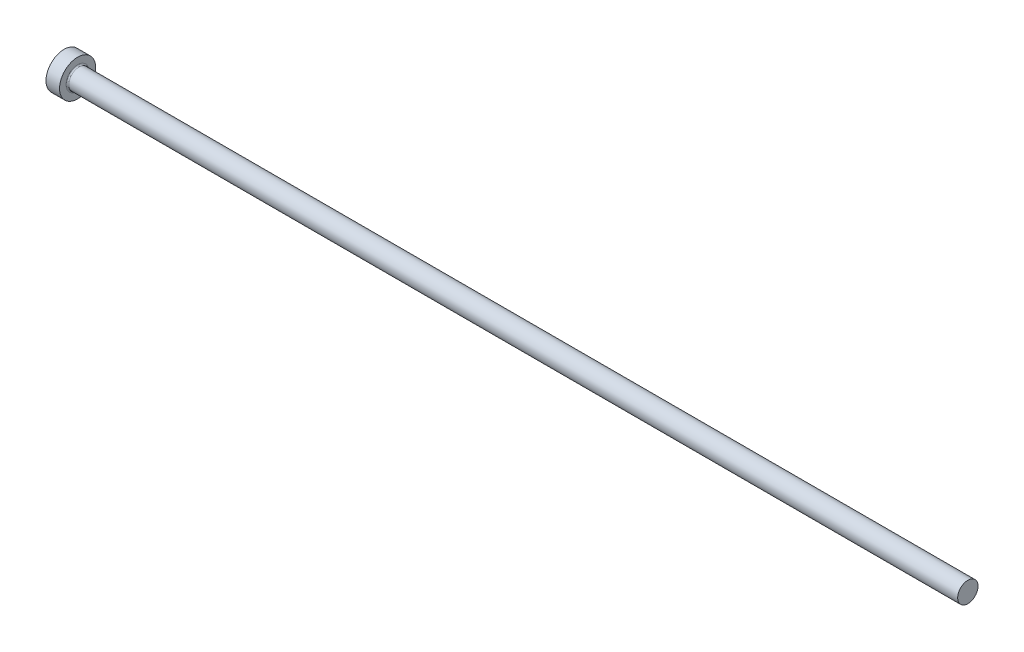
ISO-10303-21;
HEADER;
FILE_DESCRIPTION(('STEP AP214'),'2;1');
FILE_NAME('part.step','',(''),(''),'','','');
FILE_SCHEMA(('AUTOMOTIVE_DESIGN { 1 0 10303 214 1 1 1 1 }'));
ENDSEC;
DATA;
#1=APPLICATION_CONTEXT('core data for automotive mechanical design processes');
#2=APPLICATION_PROTOCOL_DEFINITION('international standard','automotive_design',2000,#1);
#3=PRODUCT_CONTEXT('',#1,'mechanical');
#4=PRODUCT('Part','Part','',(#3));
#5=PRODUCT_RELATED_PRODUCT_CATEGORY('part','',(#4));
#6=PRODUCT_DEFINITION_FORMATION('','',#4);
#7=PRODUCT_DEFINITION_CONTEXT('part definition',#1,'design');
#8=PRODUCT_DEFINITION('design','',#6,#7);
#9=PRODUCT_DEFINITION_SHAPE('','',#8);
#10=(LENGTH_UNIT() NAMED_UNIT(*) SI_UNIT(.MILLI.,.METRE.));
#11=(NAMED_UNIT(*) PLANE_ANGLE_UNIT() SI_UNIT($,.RADIAN.));
#12=(NAMED_UNIT(*) SI_UNIT($,.STERADIAN.) SOLID_ANGLE_UNIT());
#13=UNCERTAINTY_MEASURE_WITH_UNIT(LENGTH_MEASURE(1.E-05),#10,'distance_accuracy_value','');
#14=(GEOMETRIC_REPRESENTATION_CONTEXT(3) GLOBAL_UNCERTAINTY_ASSIGNED_CONTEXT((#13)) GLOBAL_UNIT_ASSIGNED_CONTEXT((#10,
#11,#12)) REPRESENTATION_CONTEXT('',''));
#15=CARTESIAN_POINT('',(0.,0.,0.));
#16=DIRECTION('',(0.,0.,1.));
#17=DIRECTION('',(1.,0.,0.));
#18=AXIS2_PLACEMENT_3D('',#15,#16,#17);
#19=CARTESIAN_POINT('',(0.,0.,0.));
#20=DIRECTION('',(-1.,0.,0.));
#21=DIRECTION('',(0.,-1.,0.));
#22=AXIS2_PLACEMENT_3D('',#19,#20,#21);
#23=PLANE('',#22);
#24=CARTESIAN_POINT('',(0.,0.,0.));
#25=DIRECTION('',(1.,0.,0.));
#26=DIRECTION('',(0.,1.,0.));
#27=AXIS2_PLACEMENT_3D('',#24,#25,#26);
#28=CIRCLE('',#27,4.);
#29=CARTESIAN_POINT('',(0.,4.,0.));
#30=VERTEX_POINT('',#29);
#31=EDGE_CURVE('E25',#30,#30,#28,.T.);
#32=ORIENTED_EDGE('',*,*,#31,.F.);
#33=EDGE_LOOP('',(#32));
#34=FACE_BOUND('',#33,.T.);
#35=ADVANCED_FACE('F14',(#34),#23,.T.);
#36=CARTESIAN_POINT('',(200.,0.,0.));
#37=DIRECTION('',(1.,0.,0.));
#38=DIRECTION('',(0.,1.,0.));
#39=AXIS2_PLACEMENT_3D('',#36,#37,#38);
#40=CYLINDRICAL_SURFACE('',#39,4.);
#41=ORIENTED_EDGE('',*,*,#31,.T.);
#42=EDGE_LOOP('',(#41));
#43=FACE_BOUND('',#42,.T.);
#44=CARTESIAN_POINT('',(3.,0.,0.));
#45=DIRECTION('',(1.,0.,0.));
#46=DIRECTION('',(0.,1.,0.));
#47=AXIS2_PLACEMENT_3D('',#44,#45,#46);
#48=CIRCLE('',#47,4.);
#49=CARTESIAN_POINT('',(3.,4.,0.));
#50=VERTEX_POINT('',#49);
#51=EDGE_CURVE('E29',#50,#50,#48,.T.);
#52=ORIENTED_EDGE('',*,*,#51,.F.);
#53=EDGE_LOOP('',(#52));
#54=FACE_BOUND('',#53,.T.);
#55=ADVANCED_FACE('F51',(#43,#54),#40,.T.);
#56=CARTESIAN_POINT('',(3.,4.,0.));
#57=DIRECTION('',(1.,0.,0.));
#58=DIRECTION('',(0.,1.,0.));
#59=AXIS2_PLACEMENT_3D('',#56,#57,#58);
#60=PLANE('',#59);
#61=CARTESIAN_POINT('',(3.,0.,0.));
#62=DIRECTION('',(1.,0.,0.));
#63=DIRECTION('',(0.,1.,0.));
#64=AXIS2_PLACEMENT_3D('',#61,#62,#63);
#65=CIRCLE('',#64,2.54999999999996);
#66=CARTESIAN_POINT('',(3.,2.54999999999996,0.));
#67=VERTEX_POINT('',#66);
#68=EDGE_CURVE('E9',#67,#67,#65,.F.);
#69=ORIENTED_EDGE('',*,*,#68,.T.);
#70=EDGE_LOOP('',(#69));
#71=FACE_BOUND('',#70,.T.);
#72=ORIENTED_EDGE('',*,*,#51,.T.);
#73=EDGE_LOOP('',(#72));
#74=FACE_BOUND('',#73,.T.);
#75=ADVANCED_FACE('F42',(#71,#74),#60,.T.);
#76=CARTESIAN_POINT('',(200.,0.,0.));
#77=DIRECTION('',(1.,0.,0.));
#78=DIRECTION('',(0.,1.,0.));
#79=AXIS2_PLACEMENT_3D('',#76,#77,#78);
#80=CYLINDRICAL_SURFACE('',#79,2.24999999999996);
#81=CARTESIAN_POINT('',(3.3,0.,0.));
#82=DIRECTION('',(1.,0.,0.));
#83=DIRECTION('',(0.,1.,0.));
#84=AXIS2_PLACEMENT_3D('',#81,#82,#83);
#85=CIRCLE('',#84,2.24999999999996);
#86=CARTESIAN_POINT('',(3.3,2.24999999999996,0.));
#87=VERTEX_POINT('',#86);
#88=EDGE_CURVE('E21',#87,#87,#85,.T.);
#89=ORIENTED_EDGE('',*,*,#88,.T.);
#90=EDGE_LOOP('',(#89));
#91=FACE_BOUND('',#90,.T.);
#92=CARTESIAN_POINT('',(200.,0.,0.));
#93=DIRECTION('',(1.,0.,0.));
#94=DIRECTION('',(0.,1.,0.));
#95=AXIS2_PLACEMENT_3D('',#92,#93,#94);
#96=CIRCLE('',#95,2.24999999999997);
#97=CARTESIAN_POINT('',(200.,2.24999999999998,0.));
#98=VERTEX_POINT('',#97);
#99=EDGE_CURVE('E34',#98,#98,#96,.T.);
#100=ORIENTED_EDGE('',*,*,#99,.F.);
#101=EDGE_LOOP('',(#100));
#102=FACE_BOUND('',#101,.T.);
#103=ADVANCED_FACE('F40',(#91,#102),#80,.T.);
#104=CARTESIAN_POINT('',(200.,2.25,0.));
#105=DIRECTION('',(1.,0.,0.));
#106=DIRECTION('',(0.,1.,0.));
#107=AXIS2_PLACEMENT_3D('',#104,#105,#106);
#108=PLANE('',#107);
#109=ORIENTED_EDGE('',*,*,#99,.T.);
#110=EDGE_LOOP('',(#109));
#111=FACE_BOUND('',#110,.T.);
#112=ADVANCED_FACE('F38',(#111),#108,.T.);
#113=CARTESIAN_POINT('',(3.3,0.,0.));
#114=DIRECTION('',(1.,0.,0.));
#115=DIRECTION('',(0.,1.,0.));
#116=AXIS2_PLACEMENT_3D('',#113,#114,#115);
#117=TOROIDAL_SURFACE('',#116,2.54999999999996,0.3);
#118=ORIENTED_EDGE('',*,*,#68,.F.);
#119=EDGE_LOOP('',(#118));
#120=FACE_BOUND('',#119,.T.);
#121=ORIENTED_EDGE('',*,*,#88,.F.);
#122=EDGE_LOOP('',(#121));
#123=FACE_BOUND('',#122,.T.);
#124=ADVANCED_FACE('F16',(#120,#123),#117,.F.);
#125=CLOSED_SHELL('',(#35,#55,#75,#103,#112,#124));
#126=MANIFOLD_SOLID_BREP('B1',#125);
#127=ADVANCED_BREP_SHAPE_REPRESENTATION('',(#18,#126),#14);
#128=SHAPE_DEFINITION_REPRESENTATION(#9,#127);
ENDSEC;
END-ISO-10303-21;
